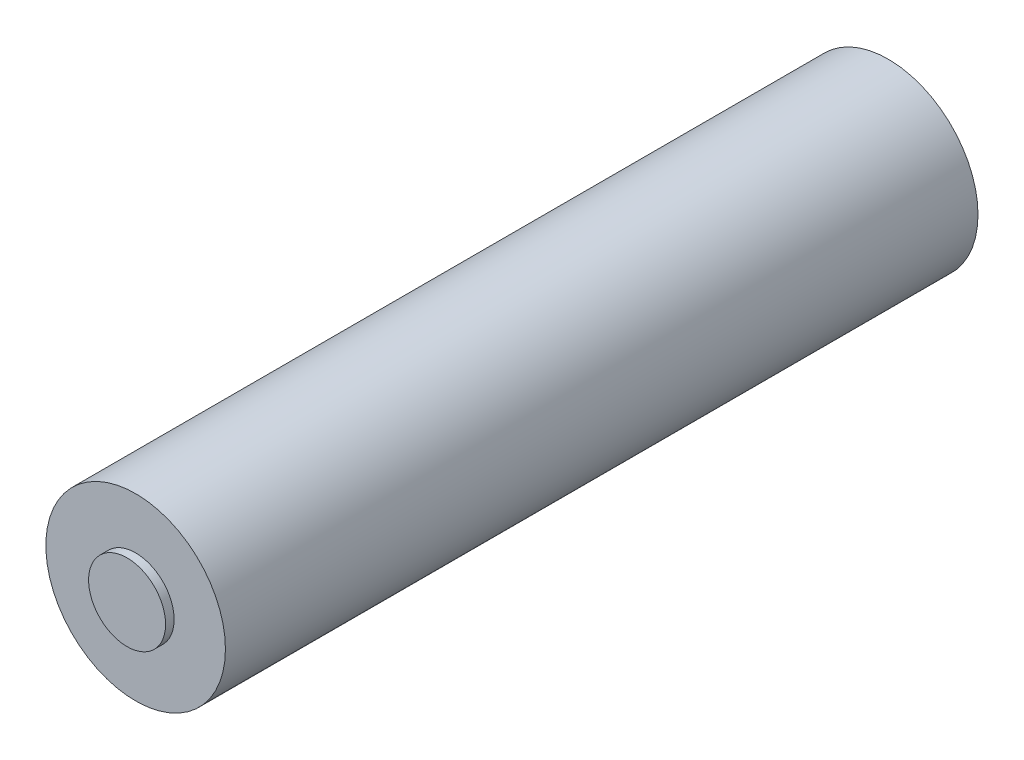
ISO-10303-21;
HEADER;
FILE_DESCRIPTION(('STEP AP214'),'2;1');
FILE_NAME('part.step','',(''),(''),'','','');
FILE_SCHEMA(('AUTOMOTIVE_DESIGN { 1 0 10303 214 1 1 1 1 }'));
ENDSEC;
DATA;
#1=APPLICATION_CONTEXT('core data for automotive mechanical design processes');
#2=APPLICATION_PROTOCOL_DEFINITION('international standard','automotive_design',2000,#1);
#3=PRODUCT_CONTEXT('',#1,'mechanical');
#4=PRODUCT('Part','Part','',(#3));
#5=PRODUCT_RELATED_PRODUCT_CATEGORY('part','',(#4));
#6=PRODUCT_DEFINITION_FORMATION('','',#4);
#7=PRODUCT_DEFINITION_CONTEXT('part definition',#1,'design');
#8=PRODUCT_DEFINITION('design','',#6,#7);
#9=PRODUCT_DEFINITION_SHAPE('','',#8);
#10=(LENGTH_UNIT() NAMED_UNIT(*) SI_UNIT(.MILLI.,.METRE.));
#11=(NAMED_UNIT(*) PLANE_ANGLE_UNIT() SI_UNIT($,.RADIAN.));
#12=(NAMED_UNIT(*) SI_UNIT($,.STERADIAN.) SOLID_ANGLE_UNIT());
#13=UNCERTAINTY_MEASURE_WITH_UNIT(LENGTH_MEASURE(1.E-05),#10,'distance_accuracy_value','');
#14=(GEOMETRIC_REPRESENTATION_CONTEXT(3) GLOBAL_UNCERTAINTY_ASSIGNED_CONTEXT((#13)) GLOBAL_UNIT_ASSIGNED_CONTEXT((#10,
#11,#12)) REPRESENTATION_CONTEXT('',''));
#15=CARTESIAN_POINT('',(0.,0.,0.));
#16=DIRECTION('',(0.,0.,1.));
#17=DIRECTION('',(1.,0.,0.));
#18=AXIS2_PLACEMENT_3D('',#15,#16,#17);
#19=CARTESIAN_POINT('',(0.,0.,44.));
#20=DIRECTION('',(0.,0.,1.));
#21=DIRECTION('',(1.,0.,0.));
#22=AXIS2_PLACEMENT_3D('',#19,#20,#21);
#23=PLANE('',#22);
#24=CARTESIAN_POINT('',(0.,0.,44.));
#25=DIRECTION('',(0.,0.,1.));
#26=DIRECTION('',(1.,0.,0.));
#27=AXIS2_PLACEMENT_3D('',#24,#25,#26);
#28=CIRCLE('',#27,5.25);
#29=CARTESIAN_POINT('',(5.25,0.,44.));
#30=VERTEX_POINT('',#29);
#31=EDGE_CURVE('E10',#30,#30,#28,.T.);
#32=ORIENTED_EDGE('',*,*,#31,.T.);
#33=EDGE_LOOP('',(#32));
#34=FACE_BOUND('',#33,.T.);
#35=CARTESIAN_POINT('',(0.,0.,44.));
#36=DIRECTION('',(0.,0.,1.));
#37=DIRECTION('',(1.,0.,0.));
#38=AXIS2_PLACEMENT_3D('',#35,#36,#37);
#39=CIRCLE('',#38,2.25);
#40=CARTESIAN_POINT('',(2.25,0.,44.));
#41=VERTEX_POINT('',#40);
#42=EDGE_CURVE('E41',#41,#41,#39,.T.);
#43=ORIENTED_EDGE('',*,*,#42,.F.);
#44=EDGE_LOOP('',(#43));
#45=FACE_BOUND('',#44,.T.);
#46=ADVANCED_FACE('F28',(#34,#45),#23,.T.);
#47=CARTESIAN_POINT('',(0.,0.,44.));
#48=DIRECTION('',(0.,0.,-1.));
#49=DIRECTION('',(-1.,0.,0.));
#50=AXIS2_PLACEMENT_3D('',#47,#48,#49);
#51=CYLINDRICAL_SURFACE('',#50,5.25);
#52=ORIENTED_EDGE('',*,*,#31,.F.);
#53=EDGE_LOOP('',(#52));
#54=FACE_BOUND('',#53,.T.);
#55=CARTESIAN_POINT('',(0.,0.,0.));
#56=DIRECTION('',(0.,0.,1.));
#57=DIRECTION('',(1.,0.,0.));
#58=AXIS2_PLACEMENT_3D('',#55,#56,#57);
#59=CIRCLE('',#58,5.25);
#60=CARTESIAN_POINT('',(5.25,0.,0.));
#61=VERTEX_POINT('',#60);
#62=EDGE_CURVE('E32',#61,#61,#59,.T.);
#63=ORIENTED_EDGE('',*,*,#62,.T.);
#64=EDGE_LOOP('',(#63));
#65=FACE_BOUND('',#64,.T.);
#66=ADVANCED_FACE('F30',(#54,#65),#51,.T.);
#67=CARTESIAN_POINT('',(0.,0.,0.));
#68=DIRECTION('',(0.,0.,1.));
#69=DIRECTION('',(1.,0.,0.));
#70=AXIS2_PLACEMENT_3D('',#67,#68,#69);
#71=PLANE('',#70);
#72=ORIENTED_EDGE('',*,*,#62,.F.);
#73=EDGE_LOOP('',(#72));
#74=FACE_BOUND('',#73,.T.);
#75=ADVANCED_FACE('F52',(#74),#71,.F.);
#76=CARTESIAN_POINT('',(0.,0.,44.5));
#77=DIRECTION('',(0.,0.,-1.));
#78=DIRECTION('',(-1.,0.,0.));
#79=AXIS2_PLACEMENT_3D('',#76,#77,#78);
#80=CYLINDRICAL_SURFACE('',#79,2.25);
#81=CARTESIAN_POINT('',(0.,0.,44.5));
#82=DIRECTION('',(0.,0.,1.));
#83=DIRECTION('',(1.,0.,0.));
#84=AXIS2_PLACEMENT_3D('',#81,#82,#83);
#85=CIRCLE('',#84,2.25);
#86=CARTESIAN_POINT('',(2.25,0.,44.5));
#87=VERTEX_POINT('',#86);
#88=EDGE_CURVE('E39',#87,#87,#85,.T.);
#89=ORIENTED_EDGE('',*,*,#88,.F.);
#90=EDGE_LOOP('',(#89));
#91=FACE_BOUND('',#90,.T.);
#92=ORIENTED_EDGE('',*,*,#42,.T.);
#93=EDGE_LOOP('',(#92));
#94=FACE_BOUND('',#93,.T.);
#95=ADVANCED_FACE('F49',(#91,#94),#80,.T.);
#96=CARTESIAN_POINT('',(0.,0.,44.5));
#97=DIRECTION('',(0.,0.,1.));
#98=DIRECTION('',(1.,0.,0.));
#99=AXIS2_PLACEMENT_3D('',#96,#97,#98);
#100=PLANE('',#99);
#101=ORIENTED_EDGE('',*,*,#88,.T.);
#102=EDGE_LOOP('',(#101));
#103=FACE_BOUND('',#102,.T.);
#104=ADVANCED_FACE('F47',(#103),#100,.T.);
#105=CLOSED_SHELL('',(#46,#66,#75,#95,#104));
#106=MANIFOLD_SOLID_BREP('B2',#105);
#107=ADVANCED_BREP_SHAPE_REPRESENTATION('',(#18,#106),#14);
#108=SHAPE_DEFINITION_REPRESENTATION(#9,#107);
ENDSEC;
END-ISO-10303-21;
